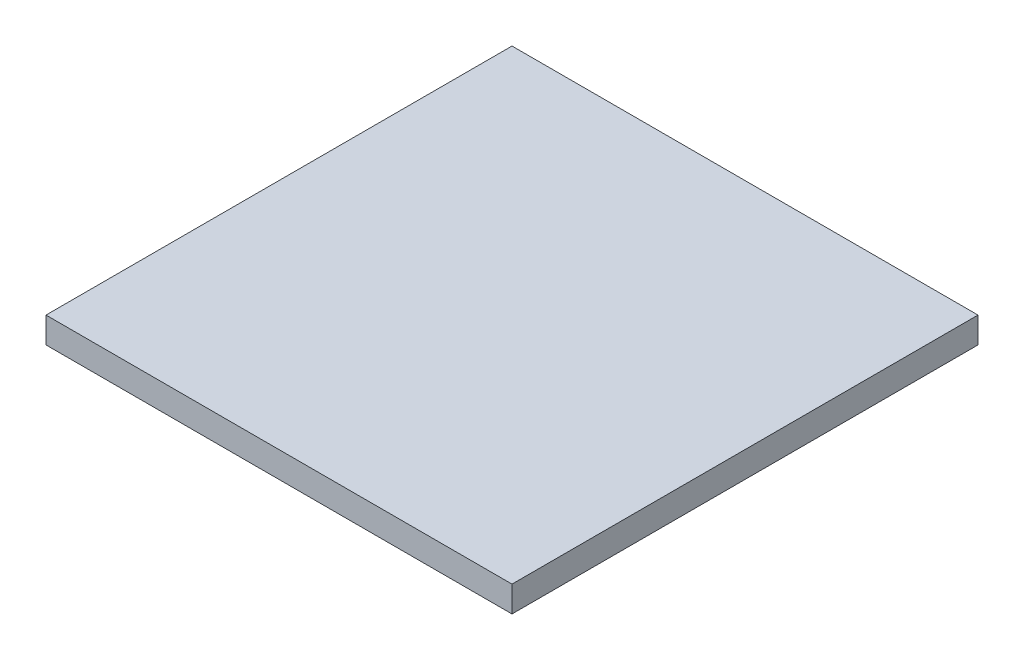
from build123d import *

# Parameters (mm, degrees)
SKETCH1_W      = 457.2
SKETCH1_H      = 457.2
EXTRUDE1_DEPTH = 25.4


with BuildPart() as part:
    # Sketch1 → Extrude1 (new body)
    with BuildSketch(Plane(origin=(0, 0, 0), x_dir=(1, 0, 0), z_dir=(0, 1, 0))):
        Rectangle(SKETCH1_W, SKETCH1_H)
    extrude(amount=-EXTRUDE1_DEPTH)


solid = part.part
